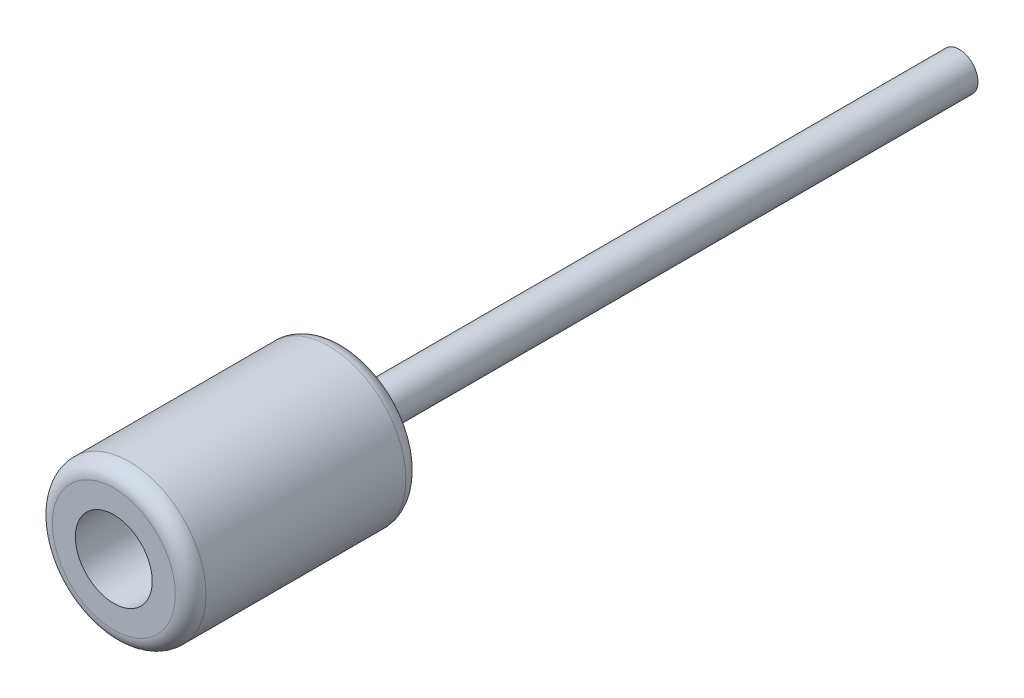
ISO-10303-21;
HEADER;
FILE_DESCRIPTION(('STEP AP214'),'2;1');
FILE_NAME('part.step','',(''),(''),'','','');
FILE_SCHEMA(('AUTOMOTIVE_DESIGN { 1 0 10303 214 1 1 1 1 }'));
ENDSEC;
DATA;
#1=APPLICATION_CONTEXT('core data for automotive mechanical design processes');
#2=APPLICATION_PROTOCOL_DEFINITION('international standard','automotive_design',2000,#1);
#3=PRODUCT_CONTEXT('',#1,'mechanical');
#4=PRODUCT('Part','Part','',(#3));
#5=PRODUCT_RELATED_PRODUCT_CATEGORY('part','',(#4));
#6=PRODUCT_DEFINITION_FORMATION('','',#4);
#7=PRODUCT_DEFINITION_CONTEXT('part definition',#1,'design');
#8=PRODUCT_DEFINITION('design','',#6,#7);
#9=PRODUCT_DEFINITION_SHAPE('','',#8);
#10=(LENGTH_UNIT() NAMED_UNIT(*) SI_UNIT(.MILLI.,.METRE.));
#11=(NAMED_UNIT(*) PLANE_ANGLE_UNIT() SI_UNIT($,.RADIAN.));
#12=(NAMED_UNIT(*) SI_UNIT($,.STERADIAN.) SOLID_ANGLE_UNIT());
#13=UNCERTAINTY_MEASURE_WITH_UNIT(LENGTH_MEASURE(1.E-05),#10,'distance_accuracy_value','');
#14=(GEOMETRIC_REPRESENTATION_CONTEXT(3) GLOBAL_UNCERTAINTY_ASSIGNED_CONTEXT((#13)) GLOBAL_UNIT_ASSIGNED_CONTEXT((#10,
#11,#12)) REPRESENTATION_CONTEXT('',''));
#15=CARTESIAN_POINT('',(0.,0.,0.));
#16=DIRECTION('',(0.,0.,1.));
#17=DIRECTION('',(1.,0.,0.));
#18=AXIS2_PLACEMENT_3D('',#15,#16,#17);
#19=CARTESIAN_POINT('',(0.,0.,38.1));
#20=DIRECTION('',(0.,0.,-1.));
#21=DIRECTION('',(-1.,0.,0.));
#22=AXIS2_PLACEMENT_3D('',#19,#20,#21);
#23=CYLINDRICAL_SURFACE('',#22,12.7);
#24=CARTESIAN_POINT('',(0.,0.,35.56));
#25=DIRECTION('',(0.,0.,1.));
#26=DIRECTION('',(1.,0.,0.));
#27=AXIS2_PLACEMENT_3D('',#24,#25,#26);
#28=CIRCLE('',#27,12.7);
#29=CARTESIAN_POINT('',(-12.7,0.,35.56));
#30=VERTEX_POINT('',#29);
#31=EDGE_CURVE('E51',#30,#30,#28,.F.);
#32=CARTESIAN_POINT('',(0.,0.,2.53999999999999));
#33=DIRECTION('',(0.,0.,1.));
#34=DIRECTION('',(1.,0.,0.));
#35=AXIS2_PLACEMENT_3D('',#32,#33,#34);
#36=CIRCLE('',#35,12.7);
#37=CARTESIAN_POINT('',(-12.7,0.,2.53999999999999));
#38=VERTEX_POINT('',#37);
#39=EDGE_CURVE('E64',#38,#38,#36,.T.);
#40=CARTESIAN_POINT('',(-12.7,0.,35.56));
#41=CARTESIAN_POINT('',(-12.7,0.,35.2160416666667));
#42=CARTESIAN_POINT('',(-12.7,0.,34.8720833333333));
#43=CARTESIAN_POINT('',(-12.7,0.,34.1841666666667));
#44=CARTESIAN_POINT('',(-12.7,0.,33.8402083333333));
#45=CARTESIAN_POINT('',(-12.7,0.,33.1522916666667));
#46=CARTESIAN_POINT('',(-12.7,0.,32.8083333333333));
#47=CARTESIAN_POINT('',(-12.7,0.,32.1204166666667));
#48=CARTESIAN_POINT('',(-12.7,0.,31.7764583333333));
#49=CARTESIAN_POINT('',(-12.7,0.,31.0885416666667));
#50=CARTESIAN_POINT('',(-12.7,0.,30.7445833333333));
#51=CARTESIAN_POINT('',(-12.7,0.,30.0566666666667));
#52=CARTESIAN_POINT('',(-12.7,0.,29.7127083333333));
#53=CARTESIAN_POINT('',(-12.7,0.,29.0247916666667));
#54=CARTESIAN_POINT('',(-12.7,0.,28.6808333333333));
#55=CARTESIAN_POINT('',(-12.7,0.,27.9929166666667));
#56=CARTESIAN_POINT('',(-12.7,0.,27.6489583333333));
#57=CARTESIAN_POINT('',(-12.7,0.,26.9610416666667));
#58=CARTESIAN_POINT('',(-12.7,0.,26.6170833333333));
#59=CARTESIAN_POINT('',(-12.7,0.,25.9291666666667));
#60=CARTESIAN_POINT('',(-12.7,0.,25.5852083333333));
#61=CARTESIAN_POINT('',(-12.7,0.,24.8972916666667));
#62=CARTESIAN_POINT('',(-12.7,0.,24.5533333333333));
#63=CARTESIAN_POINT('',(-12.7,0.,23.8654166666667));
#64=CARTESIAN_POINT('',(-12.7,0.,23.5214583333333));
#65=CARTESIAN_POINT('',(-12.7,0.,22.8335416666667));
#66=CARTESIAN_POINT('',(-12.7,0.,22.4895833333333));
#67=CARTESIAN_POINT('',(-12.7,0.,21.8016666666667));
#68=CARTESIAN_POINT('',(-12.7,0.,21.4577083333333));
#69=CARTESIAN_POINT('',(-12.7,0.,20.7697916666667));
#70=CARTESIAN_POINT('',(-12.7,0.,20.4258333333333));
#71=CARTESIAN_POINT('',(-12.7,0.,19.7379166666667));
#72=CARTESIAN_POINT('',(-12.7,0.,19.3939583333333));
#73=CARTESIAN_POINT('',(-12.7,0.,18.7060416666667));
#74=CARTESIAN_POINT('',(-12.7,0.,18.3620833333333));
#75=CARTESIAN_POINT('',(-12.7,0.,17.6741666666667));
#76=CARTESIAN_POINT('',(-12.7,0.,17.3302083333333));
#77=CARTESIAN_POINT('',(-12.7,0.,16.6422916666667));
#78=CARTESIAN_POINT('',(-12.7,0.,16.2983333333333));
#79=CARTESIAN_POINT('',(-12.7,0.,15.6104166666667));
#80=CARTESIAN_POINT('',(-12.7,0.,15.2664583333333));
#81=CARTESIAN_POINT('',(-12.7,0.,14.5785416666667));
#82=CARTESIAN_POINT('',(-12.7,0.,14.2345833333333));
#83=CARTESIAN_POINT('',(-12.7,0.,13.5466666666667));
#84=CARTESIAN_POINT('',(-12.7,0.,13.2027083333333));
#85=CARTESIAN_POINT('',(-12.7,0.,12.5147916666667));
#86=CARTESIAN_POINT('',(-12.7,0.,12.1708333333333));
#87=CARTESIAN_POINT('',(-12.7,0.,11.4829166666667));
#88=CARTESIAN_POINT('',(-12.7,0.,11.1389583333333));
#89=CARTESIAN_POINT('',(-12.7,0.,10.4510416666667));
#90=CARTESIAN_POINT('',(-12.7,0.,10.1070833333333));
#91=CARTESIAN_POINT('',(-12.7,0.,9.41916666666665));
#92=CARTESIAN_POINT('',(-12.7,0.,9.07520833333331));
#93=CARTESIAN_POINT('',(-12.7,0.,8.38729166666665));
#94=CARTESIAN_POINT('',(-12.7,0.,8.04333333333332));
#95=CARTESIAN_POINT('',(-12.7,0.,7.35541666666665));
#96=CARTESIAN_POINT('',(-12.7,0.,7.01145833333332));
#97=CARTESIAN_POINT('',(-12.7,0.,6.32354166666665));
#98=CARTESIAN_POINT('',(-12.7,0.,5.97958333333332));
#99=CARTESIAN_POINT('',(-12.7,0.,5.29166666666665));
#100=CARTESIAN_POINT('',(-12.7,0.,4.94770833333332));
#101=CARTESIAN_POINT('',(-12.7,0.,4.25979166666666));
#102=CARTESIAN_POINT('',(-12.7,0.,3.91583333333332));
#103=CARTESIAN_POINT('',(-12.7,0.,3.22791666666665));
#104=CARTESIAN_POINT('',(-12.7,0.,2.88395833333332));
#105=CARTESIAN_POINT('',(-12.7,0.,2.53999999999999));
#106=B_SPLINE_CURVE_WITH_KNOTS('',3,(#40,#41,#42,#43,#44,#45,#46,#47,#48,#49,#50,#51,#52,#53,
#54,#55,#56,#57,#58,#59,#60,#61,#62,#63,#64,#65,#66,#67,#68,#69,#70,#71,#72,#73,#74,#75,#76,#77,
#78,#79,#80,#81,#82,#83,#84,#85,#86,#87,#88,#89,#90,#91,#92,#93,#94,#95,#96,#97,#98,#99,#100,
#101,#102,#103,#104,#105),.UNSPECIFIED.,.F.,.F.,(4,2,2,2,2,2,2,2,2,2,2,2,2,2,2,2,2,2,2,2,2,2,2,
2,2,2,2,2,2,2,2,2,4),(0.,1.031875,2.06375,3.095625,4.12750000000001,5.15937500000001,
6.19125000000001,7.223125,8.25500000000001,9.28687500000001,10.31875,11.350625,12.3825,
13.414375,14.44625,15.478125,16.51,17.541875,18.57375,19.605625,20.6375,21.669375,22.70125,
23.733125,24.765,25.796875,26.82875,27.860625,28.8925,29.924375,30.95625,31.988125,33.02),.UNSPECIFIED.);
#107=EDGE_CURVE('BSEAM44',#30,#38,#106,.T.);
#108=ORIENTED_EDGE('',*,*,#31,.T.);
#109=ORIENTED_EDGE('',*,*,#39,.T.);
#110=ORIENTED_EDGE('',*,*,#107,.T.);
#111=ORIENTED_EDGE('',*,*,#107,.F.);
#112=EDGE_LOOP('',(#108,#110,#109,#111));
#113=FACE_BOUND('',#112,.T.);
#114=ADVANCED_FACE('F44',(#113),#23,.T.);
#115=CARTESIAN_POINT('',(0.,0.,38.1));
#116=DIRECTION('',(0.,0.,1.));
#117=DIRECTION('',(1.,0.,0.));
#118=AXIS2_PLACEMENT_3D('',#115,#116,#117);
#119=PLANE('',#118);
#120=CARTESIAN_POINT('',(0.,0.,38.1));
#121=DIRECTION('',(0.,0.,1.));
#122=DIRECTION('',(1.,0.,0.));
#123=AXIS2_PLACEMENT_3D('',#120,#121,#122);
#124=CIRCLE('',#123,10.16);
#125=CARTESIAN_POINT('',(10.16,0.,38.1));
#126=VERTEX_POINT('',#125);
#127=EDGE_CURVE('E55',#126,#126,#124,.T.);
#128=ORIENTED_EDGE('',*,*,#127,.T.);
#129=EDGE_LOOP('',(#128));
#130=FACE_BOUND('',#129,.T.);
#131=CARTESIAN_POINT('',(0.,0.,38.1));
#132=DIRECTION('',(0.,0.,1.));
#133=DIRECTION('',(1.,0.,0.));
#134=AXIS2_PLACEMENT_3D('',#131,#132,#133);
#135=CIRCLE('',#134,6.35);
#136=CARTESIAN_POINT('',(-6.35,0.,38.1));
#137=VERTEX_POINT('',#136);
#138=EDGE_CURVE('E67',#137,#137,#135,.T.);
#139=ORIENTED_EDGE('',*,*,#138,.F.);
#140=EDGE_LOOP('',(#139));
#141=FACE_BOUND('',#140,.T.);
#142=ADVANCED_FACE('F91',(#130,#141),#119,.T.);
#143=CARTESIAN_POINT('',(0.,0.,0.));
#144=DIRECTION('',(0.,0.,1.));
#145=DIRECTION('',(1.,0.,0.));
#146=AXIS2_PLACEMENT_3D('',#143,#144,#145);
#147=PLANE('',#146);
#148=CARTESIAN_POINT('',(0.,0.,0.));
#149=DIRECTION('',(0.,0.,1.));
#150=DIRECTION('',(1.,0.,0.));
#151=AXIS2_PLACEMENT_3D('',#148,#149,#150);
#152=CIRCLE('',#151,3.1115);
#153=CARTESIAN_POINT('',(3.1115,0.,0.));
#154=VERTEX_POINT('',#153);
#155=EDGE_CURVE('E12',#154,#154,#152,.F.);
#156=ORIENTED_EDGE('',*,*,#155,.F.);
#157=EDGE_LOOP('',(#156));
#158=FACE_BOUND('',#157,.T.);
#159=CARTESIAN_POINT('',(0.,0.,0.));
#160=DIRECTION('',(0.,0.,1.));
#161=DIRECTION('',(1.,0.,0.));
#162=AXIS2_PLACEMENT_3D('',#159,#160,#161);
#163=CIRCLE('',#162,10.16);
#164=CARTESIAN_POINT('',(10.16,0.,0.));
#165=VERTEX_POINT('',#164);
#166=EDGE_CURVE('E59',#165,#165,#163,.F.);
#167=ORIENTED_EDGE('',*,*,#166,.T.);
#168=EDGE_LOOP('',(#167));
#169=FACE_BOUND('',#168,.T.);
#170=ADVANCED_FACE('F96',(#158,#169),#147,.F.);
#171=CARTESIAN_POINT('',(0.,0.,38.1));
#172=DIRECTION('',(0.,0.,-1.));
#173=DIRECTION('',(-1.,0.,0.));
#174=AXIS2_PLACEMENT_3D('',#171,#172,#173);
#175=CYLINDRICAL_SURFACE('',#174,6.35);
#176=CARTESIAN_POINT('',(0.,0.,6.35));
#177=DIRECTION('',(0.,0.,1.));
#178=DIRECTION('',(1.,0.,0.));
#179=AXIS2_PLACEMENT_3D('',#176,#177,#178);
#180=CIRCLE('',#179,6.35);
#181=CARTESIAN_POINT('',(-6.35,0.,6.34999999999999));
#182=VERTEX_POINT('',#181);
#183=EDGE_CURVE('E70',#182,#182,#180,.T.);
#184=CARTESIAN_POINT('',(-6.35,0.,38.1));
#185=CARTESIAN_POINT('',(-6.35,0.,37.7692708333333));
#186=CARTESIAN_POINT('',(-6.35,0.,37.4385416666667));
#187=CARTESIAN_POINT('',(-6.35,0.,36.7770833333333));
#188=CARTESIAN_POINT('',(-6.35,0.,36.4463541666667));
#189=CARTESIAN_POINT('',(-6.35,0.,35.7848958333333));
#190=CARTESIAN_POINT('',(-6.35,0.,35.4541666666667));
#191=CARTESIAN_POINT('',(-6.35,0.,34.7927083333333));
#192=CARTESIAN_POINT('',(-6.35,0.,34.4619791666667));
#193=CARTESIAN_POINT('',(-6.35,0.,33.8005208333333));
#194=CARTESIAN_POINT('',(-6.35,0.,33.4697916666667));
#195=CARTESIAN_POINT('',(-6.35,0.,32.8083333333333));
#196=CARTESIAN_POINT('',(-6.35,0.,32.4776041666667));
#197=CARTESIAN_POINT('',(-6.35,0.,31.8161458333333));
#198=CARTESIAN_POINT('',(-6.35,0.,31.4854166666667));
#199=CARTESIAN_POINT('',(-6.35,0.,30.8239583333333));
#200=CARTESIAN_POINT('',(-6.35,0.,30.4932291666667));
#201=CARTESIAN_POINT('',(-6.35,0.,29.8317708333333));
#202=CARTESIAN_POINT('',(-6.35,0.,29.5010416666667));
#203=CARTESIAN_POINT('',(-6.35,0.,28.8395833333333));
#204=CARTESIAN_POINT('',(-6.35,0.,28.5088541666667));
#205=CARTESIAN_POINT('',(-6.35,0.,27.8473958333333));
#206=CARTESIAN_POINT('',(-6.35,0.,27.5166666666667));
#207=CARTESIAN_POINT('',(-6.35,0.,26.8552083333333));
#208=CARTESIAN_POINT('',(-6.35,0.,26.5244791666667));
#209=CARTESIAN_POINT('',(-6.35,0.,25.8630208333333));
#210=CARTESIAN_POINT('',(-6.35,0.,25.5322916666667));
#211=CARTESIAN_POINT('',(-6.35,0.,24.8708333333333));
#212=CARTESIAN_POINT('',(-6.35,0.,24.5401041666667));
#213=CARTESIAN_POINT('',(-6.35,0.,23.8786458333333));
#214=CARTESIAN_POINT('',(-6.35,0.,23.5479166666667));
#215=CARTESIAN_POINT('',(-6.35,0.,22.8864583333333));
#216=CARTESIAN_POINT('',(-6.35,0.,22.5557291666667));
#217=CARTESIAN_POINT('',(-6.35,0.,21.8942708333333));
#218=CARTESIAN_POINT('',(-6.35,0.,21.5635416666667));
#219=CARTESIAN_POINT('',(-6.35,0.,20.9020833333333));
#220=CARTESIAN_POINT('',(-6.35,0.,20.5713541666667));
#221=CARTESIAN_POINT('',(-6.35,0.,19.9098958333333));
#222=CARTESIAN_POINT('',(-6.35,0.,19.5791666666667));
#223=CARTESIAN_POINT('',(-6.35,0.,18.9177083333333));
#224=CARTESIAN_POINT('',(-6.35,0.,18.5869791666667));
#225=CARTESIAN_POINT('',(-6.35,0.,17.9255208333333));
#226=CARTESIAN_POINT('',(-6.35,0.,17.5947916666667));
#227=CARTESIAN_POINT('',(-6.35,0.,16.9333333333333));
#228=CARTESIAN_POINT('',(-6.35,0.,16.6026041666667));
#229=CARTESIAN_POINT('',(-6.35,0.,15.9411458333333));
#230=CARTESIAN_POINT('',(-6.35,0.,15.6104166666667));
#231=CARTESIAN_POINT('',(-6.35,0.,14.9489583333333));
#232=CARTESIAN_POINT('',(-6.35,0.,14.6182291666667));
#233=CARTESIAN_POINT('',(-6.35,0.,13.9567708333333));
#234=CARTESIAN_POINT('',(-6.35,0.,13.6260416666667));
#235=CARTESIAN_POINT('',(-6.35,0.,12.9645833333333));
#236=CARTESIAN_POINT('',(-6.35,0.,12.6338541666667));
#237=CARTESIAN_POINT('',(-6.35,0.,11.9723958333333));
#238=CARTESIAN_POINT('',(-6.35,0.,11.6416666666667));
#239=CARTESIAN_POINT('',(-6.35,0.,10.9802083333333));
#240=CARTESIAN_POINT('',(-6.35,0.,10.6494791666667));
#241=CARTESIAN_POINT('',(-6.35,0.,9.98802083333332));
#242=CARTESIAN_POINT('',(-6.35,0.,9.65729166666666));
#243=CARTESIAN_POINT('',(-6.35,0.,8.99583333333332));
#244=CARTESIAN_POINT('',(-6.35,0.,8.66510416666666));
#245=CARTESIAN_POINT('',(-6.35,0.,8.00364583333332));
#246=CARTESIAN_POINT('',(-6.35,0.,7.67291666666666));
#247=CARTESIAN_POINT('',(-6.35,0.,7.01145833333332));
#248=CARTESIAN_POINT('',(-6.35,0.,6.68072916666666));
#249=CARTESIAN_POINT('',(-6.35,0.,6.34999999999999));
#250=B_SPLINE_CURVE_WITH_KNOTS('',3,(#184,#185,#186,#187,#188,#189,#190,#191,#192,#193,#194,
#195,#196,#197,#198,#199,#200,#201,#202,#203,#204,#205,#206,#207,#208,#209,#210,#211,#212,#213,
#214,#215,#216,#217,#218,#219,#220,#221,#222,#223,#224,#225,#226,#227,#228,#229,#230,#231,#232,
#233,#234,#235,#236,#237,#238,#239,#240,#241,#242,#243,#244,#245,#246,#247,#248,#249),
.UNSPECIFIED.,.F.,.F.,(4,2,2,2,2,2,2,2,2,2,2,2,2,2,2,2,2,2,2,2,2,2,2,2,2,2,2,2,2,2,2,2,4),(0.,
0.992187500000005,1.984375,2.9765625,3.96875000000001,4.96093750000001,5.953125,
6.94531250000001,7.93750000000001,8.92968750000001,9.921875,10.9140625,11.90625,12.8984375,
13.890625,14.8828125,15.875,16.8671875,17.859375,18.8515625,19.84375,20.8359375,21.828125,
22.8203125,23.8125,24.8046875,25.796875,26.7890625,27.78125,28.7734375,29.765625,30.7578125,
31.75),.UNSPECIFIED.);
#251=EDGE_CURVE('BSEAM107',#137,#182,#250,.T.);
#252=ORIENTED_EDGE('',*,*,#138,.T.);
#253=ORIENTED_EDGE('',*,*,#183,.F.);
#254=ORIENTED_EDGE('',*,*,#251,.T.);
#255=ORIENTED_EDGE('',*,*,#251,.F.);
#256=EDGE_LOOP('',(#252,#254,#253,#255));
#257=FACE_BOUND('',#256,.T.);
#258=ADVANCED_FACE('F107',(#257),#175,.F.);
#259=CARTESIAN_POINT('',(0.,0.,6.35));
#260=DIRECTION('',(0.,0.,1.));
#261=DIRECTION('',(1.,0.,0.));
#262=AXIS2_PLACEMENT_3D('',#259,#260,#261);
#263=PLANE('',#262);
#264=ORIENTED_EDGE('',*,*,#183,.T.);
#265=EDGE_LOOP('',(#264));
#266=FACE_BOUND('',#265,.T.);
#267=ADVANCED_FACE('F102',(#266),#263,.T.);
#268=CARTESIAN_POINT('',(0.,0.,2.54));
#269=DIRECTION('',(0.,0.,1.));
#270=DIRECTION('',(1.,0.,0.));
#271=AXIS2_PLACEMENT_3D('',#268,#269,#270);
#272=TOROIDAL_SURFACE('',#271,10.16,2.54);
#273=ORIENTED_EDGE('',*,*,#166,.F.);
#274=EDGE_LOOP('',(#273));
#275=FACE_BOUND('',#274,.T.);
#276=ORIENTED_EDGE('',*,*,#39,.F.);
#277=EDGE_LOOP('',(#276));
#278=FACE_BOUND('',#277,.T.);
#279=ADVANCED_FACE('F87',(#275,#278),#272,.T.);
#280=CARTESIAN_POINT('',(0.,0.,35.56));
#281=DIRECTION('',(0.,0.,1.));
#282=DIRECTION('',(1.,0.,0.));
#283=AXIS2_PLACEMENT_3D('',#280,#281,#282);
#284=TOROIDAL_SURFACE('',#283,10.16,2.54);
#285=ORIENTED_EDGE('',*,*,#31,.F.);
#286=EDGE_LOOP('',(#285));
#287=FACE_BOUND('',#286,.T.);
#288=ORIENTED_EDGE('',*,*,#127,.F.);
#289=EDGE_LOOP('',(#288));
#290=FACE_BOUND('',#289,.T.);
#291=ADVANCED_FACE('F46',(#287,#290),#284,.T.);
#292=CARTESIAN_POINT('',(0.,0.,-101.6));
#293=DIRECTION('',(0.,0.,1.));
#294=DIRECTION('',(1.,0.,0.));
#295=AXIS2_PLACEMENT_3D('',#292,#293,#294);
#296=CYLINDRICAL_SURFACE('',#295,3.1115);
#297=CARTESIAN_POINT('',(0.,0.,-101.6));
#298=DIRECTION('',(0.,0.,-1.));
#299=DIRECTION('',(-1.,0.,0.));
#300=AXIS2_PLACEMENT_3D('',#297,#298,#299);
#301=CIRCLE('',#300,3.1115);
#302=CARTESIAN_POINT('',(-3.1115,0.,-101.6));
#303=VERTEX_POINT('',#302);
#304=EDGE_CURVE('E73',#303,#303,#301,.T.);
#305=ORIENTED_EDGE('',*,*,#304,.F.);
#306=EDGE_LOOP('',(#305));
#307=FACE_BOUND('',#306,.T.);
#308=ORIENTED_EDGE('',*,*,#155,.T.);
#309=EDGE_LOOP('',(#308));
#310=FACE_BOUND('',#309,.T.);
#311=ADVANCED_FACE('F79',(#307,#310),#296,.T.);
#312=CARTESIAN_POINT('',(0.,0.,-101.6));
#313=DIRECTION('',(0.,0.,-1.));
#314=DIRECTION('',(-1.,0.,0.));
#315=AXIS2_PLACEMENT_3D('',#312,#313,#314);
#316=PLANE('',#315);
#317=ORIENTED_EDGE('',*,*,#304,.T.);
#318=EDGE_LOOP('',(#317));
#319=FACE_BOUND('',#318,.T.);
#320=ADVANCED_FACE('F77',(#319),#316,.T.);
#321=CLOSED_SHELL('',(#114,#142,#170,#258,#267,#279,#291,#311,#320));
#322=MANIFOLD_SOLID_BREP('B2',#321);
#323=ADVANCED_BREP_SHAPE_REPRESENTATION('',(#18,#322),#14);
#324=SHAPE_DEFINITION_REPRESENTATION(#9,#323);
ENDSEC;
END-ISO-10303-21;
